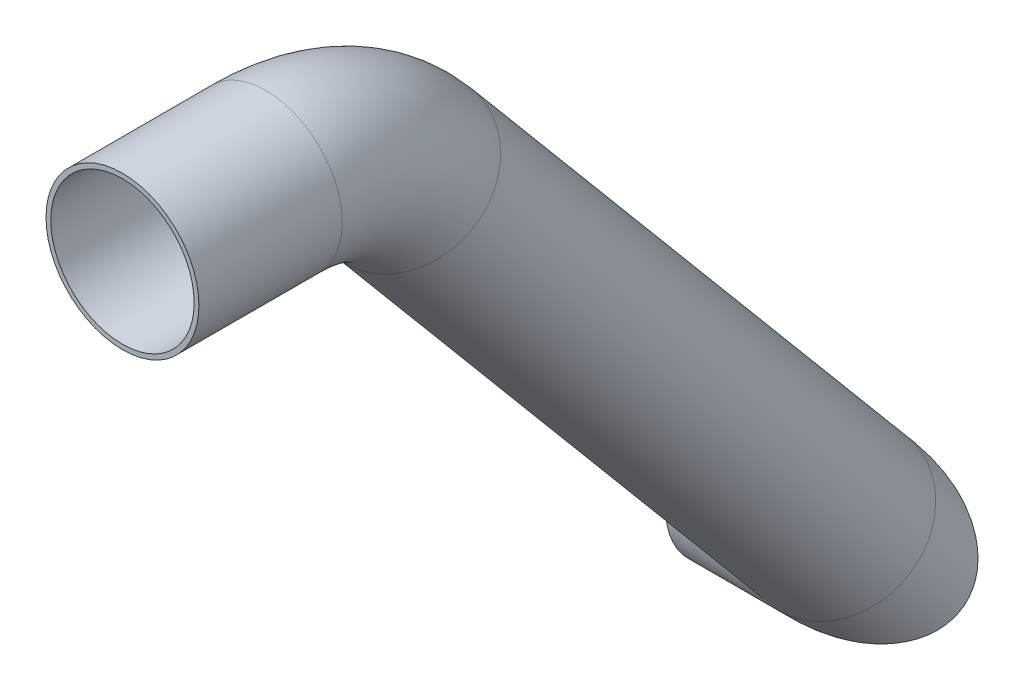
ISO-10303-21;
HEADER;
FILE_DESCRIPTION(('STEP AP214'),'2;1');
FILE_NAME('part.step','',(''),(''),'','','');
FILE_SCHEMA(('AUTOMOTIVE_DESIGN { 1 0 10303 214 1 1 1 1 }'));
ENDSEC;
DATA;
#1=APPLICATION_CONTEXT('core data for automotive mechanical design processes');
#2=APPLICATION_PROTOCOL_DEFINITION('international standard','automotive_design',2000,#1);
#3=PRODUCT_CONTEXT('',#1,'mechanical');
#4=PRODUCT('Part','Part','',(#3));
#5=PRODUCT_RELATED_PRODUCT_CATEGORY('part','',(#4));
#6=PRODUCT_DEFINITION_FORMATION('','',#4);
#7=PRODUCT_DEFINITION_CONTEXT('part definition',#1,'design');
#8=PRODUCT_DEFINITION('design','',#6,#7);
#9=PRODUCT_DEFINITION_SHAPE('','',#8);
#10=(LENGTH_UNIT() NAMED_UNIT(*) SI_UNIT(.MILLI.,.METRE.));
#11=(NAMED_UNIT(*) PLANE_ANGLE_UNIT() SI_UNIT($,.RADIAN.));
#12=(NAMED_UNIT(*) SI_UNIT($,.STERADIAN.) SOLID_ANGLE_UNIT());
#13=UNCERTAINTY_MEASURE_WITH_UNIT(LENGTH_MEASURE(1.E-05),#10,'distance_accuracy_value','');
#14=(GEOMETRIC_REPRESENTATION_CONTEXT(3) GLOBAL_UNCERTAINTY_ASSIGNED_CONTEXT((#13)) GLOBAL_UNIT_ASSIGNED_CONTEXT((#10,
#11,#12)) REPRESENTATION_CONTEXT('',''));
#15=CARTESIAN_POINT('',(0.,0.,0.));
#16=DIRECTION('',(0.,0.,1.));
#17=DIRECTION('',(1.,0.,0.));
#18=AXIS2_PLACEMENT_3D('',#15,#16,#17);
#19=CARTESIAN_POINT('',(-160.,0.,0.));
#20=DIRECTION('',(1.,0.,0.));
#21=DIRECTION('',(0.,0.,-1.));
#22=AXIS2_PLACEMENT_3D('',#19,#20,#21);
#23=CYLINDRICAL_SURFACE('',#22,150.);
#24=CARTESIAN_POINT('',(-203.56,0.,0.));
#25=DIRECTION('',(1.,0.,0.));
#26=DIRECTION('',(0.,0.,-1.));
#27=AXIS2_PLACEMENT_3D('',#24,#25,#26);
#28=CIRCLE('',#27,150.);
#29=CARTESIAN_POINT('',(-203.56,0.,-150.));
#30=VERTEX_POINT('',#29);
#31=EDGE_CURVE('E115',#30,#30,#28,.T.);
#32=ORIENTED_EDGE('',*,*,#31,.F.);
#33=EDGE_LOOP('',(#32));
#34=FACE_BOUND('',#33,.T.);
#35=CARTESIAN_POINT('',(0.,0.,0.));
#36=DIRECTION('',(-0.707106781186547,-0.541675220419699,-0.454519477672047));
#37=DIRECTION('',(-0.707106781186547,0.541675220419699,0.454519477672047));
#38=AXIS2_PLACEMENT_3D('',#35,#36,#37);
#39=ELLIPSE('',#38,212.132034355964,150.);
#40=CARTESIAN_POINT('',(-150.,114.906666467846,96.4181414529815));
#41=VERTEX_POINT('',#40);
#42=EDGE_CURVE('E93',#41,#41,#39,.T.);
#43=ORIENTED_EDGE('',*,*,#42,.F.);
#44=EDGE_LOOP('',(#43));
#45=FACE_BOUND('',#44,.T.);
#46=CARTESIAN_POINT('',(0.,-121.078910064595,-88.5431958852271));
#47=CARTESIAN_POINT('',(0.280617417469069,-121.078911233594,-88.5431938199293));
#48=CARTESIAN_POINT('',(0.561197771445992,-121.071920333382,-88.5527562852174));
#49=CARTESIAN_POINT('',(1.12045310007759,-121.043993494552,-88.5909262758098));
#50=CARTESIAN_POINT('',(1.39912757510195,-121.023054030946,-88.619538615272));
#51=CARTESIAN_POINT('',(1.95277616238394,-120.96730908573,-88.6956162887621));
#52=CARTESIAN_POINT('',(2.22774619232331,-120.932489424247,-88.7431009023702));
#53=CARTESIAN_POINT('',(2.77174912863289,-120.84917180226,-88.8565283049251));
#54=CARTESIAN_POINT('',(3.04078192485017,-120.800673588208,-88.9224714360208));
#55=CARTESIAN_POINT('',(3.57084536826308,-120.690292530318,-89.0722287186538));
#56=CARTESIAN_POINT('',(3.83188036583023,-120.628417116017,-89.1560329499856));
#57=CARTESIAN_POINT('',(4.34425997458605,-120.491601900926,-89.3408477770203));
#58=CARTESIAN_POINT('',(4.59560443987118,-120.416661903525,-89.4418586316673));
#59=CARTESIAN_POINT('',(5.08676684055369,-120.254147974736,-89.6602387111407));
#60=CARTESIAN_POINT('',(5.32658736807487,-120.166576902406,-89.7776042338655));
#61=CARTESIAN_POINT('',(5.79306663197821,-119.979275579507,-90.027761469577));
#62=CARTESIAN_POINT('',(6.0197256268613,-119.879545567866,-90.1605528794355));
#63=CARTESIAN_POINT('',(6.45862024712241,-119.668325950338,-90.4407130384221));
#64=CARTESIAN_POINT('',(6.67083365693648,-119.556818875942,-90.5881034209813));
#65=CARTESIAN_POINT('',(7.0789630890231,-119.32280652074,-90.8961233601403));
#66=CARTESIAN_POINT('',(7.27487908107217,-119.20030121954,-91.0567529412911));
#67=CARTESIAN_POINT('',(7.64903560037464,-118.945000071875,-91.3899940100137));
#68=CARTESIAN_POINT('',(7.82727539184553,-118.812203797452,-91.5626059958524));
#69=CARTESIAN_POINT('',(8.16480727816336,-118.5371134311,-91.9184600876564));
#70=CARTESIAN_POINT('',(8.32409937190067,-118.394819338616,-92.1017021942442));
#71=CARTESIAN_POINT('',(8.62274155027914,-118.101461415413,-92.4775739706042));
#72=CARTESIAN_POINT('',(8.76207317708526,-117.950389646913,-92.6702121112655));
#73=CARTESIAN_POINT('',(9.01962543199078,-117.64053440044,-93.0632434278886));
#74=CARTESIAN_POINT('',(9.13784604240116,-117.481750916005,-93.2636366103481));
#75=CARTESIAN_POINT('',(9.3523280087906,-117.157484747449,-93.67065421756));
#76=CARTESIAN_POINT('',(9.44858957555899,-116.992002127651,-93.8772785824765));
#77=CARTESIAN_POINT('',(9.61846252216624,-116.655415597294,-94.295206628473));
#78=CARTESIAN_POINT('',(9.6920739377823,-116.484311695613,-94.5065103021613));
#79=CARTESIAN_POINT('',(9.81602256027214,-116.137885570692,-94.9319053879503));
#80=CARTESIAN_POINT('',(9.86639452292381,-115.962570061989,-95.1459921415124));
#81=CARTESIAN_POINT('',(9.94366364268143,-115.608668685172,-95.5756935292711));
#82=CARTESIAN_POINT('',(9.97056082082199,-115.430082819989,-95.7913081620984));
#83=CARTESIAN_POINT('',(10.0006859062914,-115.070887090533,-96.2225008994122));
#84=CARTESIAN_POINT('',(10.0039140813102,-114.890277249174,-96.4380790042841));
#85=CARTESIAN_POINT('',(9.98667851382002,-114.528316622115,-96.8676601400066));
#86=CARTESIAN_POINT('',(9.96621479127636,-114.346965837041,-97.0816631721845));
#87=CARTESIAN_POINT('',(9.90179478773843,-113.985127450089,-97.5062480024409));
#88=CARTESIAN_POINT('',(9.85787595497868,-113.804638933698,-97.7168347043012));
#89=CARTESIAN_POINT('',(9.74688530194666,-113.445563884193,-98.1334788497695));
#90=CARTESIAN_POINT('',(9.67981351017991,-113.266977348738,-98.3395362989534));
#91=CARTESIAN_POINT('',(9.52299784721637,-112.913042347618,-98.7457211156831));
#92=CARTESIAN_POINT('',(9.43325386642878,-112.737693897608,-98.9458484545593));
#93=CARTESIAN_POINT('',(9.23173590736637,-112.391569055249,-99.3388331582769));
#94=CARTESIAN_POINT('',(9.11996190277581,-112.220792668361,-99.5316905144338));
#95=CARTESIAN_POINT('',(8.87508332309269,-111.884996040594,-99.9090161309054));
#96=CARTESIAN_POINT('',(8.74196186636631,-111.719980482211,-100.09347760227));
#97=CARTESIAN_POINT('',(8.45539899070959,-111.397140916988,-100.45265209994));
#98=CARTESIAN_POINT('',(8.30195756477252,-111.239316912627,-100.627365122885));
#99=CARTESIAN_POINT('',(7.97584089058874,-110.932111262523,-100.965929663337));
#100=CARTESIAN_POINT('',(7.8031654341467,-110.78272970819,-101.129781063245));
#101=CARTESIAN_POINT('',(7.43980285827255,-110.49361132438,-101.445589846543));
#102=CARTESIAN_POINT('',(7.24911571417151,-110.353874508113,-101.597547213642));
#103=CARTESIAN_POINT('',(6.85068731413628,-110.084920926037,-101.888908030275));
#104=CARTESIAN_POINT('',(6.64291356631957,-109.955725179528,-102.028286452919));
#105=CARTESIAN_POINT('',(6.21210491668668,-109.709225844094,-102.29329657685));
#106=CARTESIAN_POINT('',(5.98906999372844,-109.591922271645,-102.418928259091));
#107=CARTESIAN_POINT('',(5.52931672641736,-109.370188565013,-102.65567772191));
#108=CARTESIAN_POINT('',(5.29259836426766,-109.265758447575,-102.76679548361));
#109=CARTESIAN_POINT('',(4.8071545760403,-109.070655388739,-102.973843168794));
#110=CARTESIAN_POINT('',(4.55842915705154,-108.979982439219,-103.069773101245));
#111=CARTESIAN_POINT('',(4.05071700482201,-108.813163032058,-103.245872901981));
#112=CARTESIAN_POINT('',(3.79172956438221,-108.737017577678,-103.326041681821));
#113=CARTESIAN_POINT('',(3.26534933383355,-108.599918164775,-103.470129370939));
#114=CARTESIAN_POINT('',(2.99795654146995,-108.538964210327,-103.534048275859));
#115=CARTESIAN_POINT('',(2.45667224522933,-108.432778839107,-103.645252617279));
#116=CARTESIAN_POINT('',(2.18278081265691,-108.387547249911,-103.692538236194));
#117=CARTESIAN_POINT('',(1.63045023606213,-108.313201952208,-103.77019406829));
#118=CARTESIAN_POINT('',(1.35201109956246,-108.284088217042,-103.800564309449));
#119=CARTESIAN_POINT('',(0.793112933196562,-108.242275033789,-103.84416598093));
#120=CARTESIAN_POINT('',(0.512658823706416,-108.229544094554,-103.857430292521));
#121=CARTESIAN_POINT('',(-0.0488006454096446,-108.220505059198,-103.86684903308));
#122=CARTESIAN_POINT('',(-0.329806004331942,-108.224196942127,-103.863003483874));
#123=CARTESIAN_POINT('',(-0.890364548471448,-108.247970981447,-103.838225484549));
#124=CARTESIAN_POINT('',(-1.1699177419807,-108.268053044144,-103.817293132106));
#125=CARTESIAN_POINT('',(-1.72558316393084,-108.324430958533,-103.758466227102));
#126=CARTESIAN_POINT('',(-2.00169539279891,-108.360726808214,-103.720571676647));
#127=CARTESIAN_POINT('',(-2.54826540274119,-108.449174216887,-103.628088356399));
#128=CARTESIAN_POINT('',(-2.81872811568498,-108.501311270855,-103.573514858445));
#129=CARTESIAN_POINT('',(-3.35234210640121,-108.620999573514,-103.447986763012));
#130=CARTESIAN_POINT('',(-3.61549339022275,-108.688550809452,-103.377032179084));
#131=CARTESIAN_POINT('',(-4.13262580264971,-108.838485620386,-103.219164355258));
#132=CARTESIAN_POINT('',(-4.38660685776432,-108.920869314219,-103.132250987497));
#133=CARTESIAN_POINT('',(-4.88360436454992,-109.099764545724,-102.942985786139));
#134=CARTESIAN_POINT('',(-5.12662079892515,-109.196276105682,-102.840633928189));
#135=CARTESIAN_POINT('',(-5.60033787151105,-109.402767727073,-102.620939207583));
#136=CARTESIAN_POINT('',(-5.83101915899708,-109.512768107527,-102.503573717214));
#137=CARTESIAN_POINT('',(-6.27803753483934,-109.745196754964,-102.25468580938));
#138=CARTESIAN_POINT('',(-6.49437461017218,-109.867625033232,-102.123163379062));
#139=CARTESIAN_POINT('',(-6.91117994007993,-110.123894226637,-101.84676443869));
#140=CARTESIAN_POINT('',(-7.11164803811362,-110.25773525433,-101.701887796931));
#141=CARTESIAN_POINT('',(-7.49529762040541,-110.535730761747,-101.399676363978));
#142=CARTESIAN_POINT('',(-7.67847909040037,-110.67988524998,-101.242341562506));
#143=CARTESIAN_POINT('',(-8.02653559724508,-110.977575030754,-100.915938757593));
#144=CARTESIAN_POINT('',(-8.19138117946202,-111.131124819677,-100.746852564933));
#145=CARTESIAN_POINT('',(-8.50125915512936,-111.446165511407,-100.398243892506));
#146=CARTESIAN_POINT('',(-8.64629152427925,-111.607656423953,-100.218721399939));
#147=CARTESIAN_POINT('',(-8.9155077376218,-111.937298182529,-99.8503998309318));
#148=CARTESIAN_POINT('',(-9.03969168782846,-112.105448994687,-99.6616008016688));
#149=CARTESIAN_POINT('',(-9.26632289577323,-112.447095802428,-99.2759638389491));
#150=CARTESIAN_POINT('',(-9.36877018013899,-112.620591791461,-99.0791259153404));
#151=CARTESIAN_POINT('',(-9.55111705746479,-112.971446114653,-98.6788889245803));
#152=CARTESIAN_POINT('',(-9.63103515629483,-113.148801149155,-98.4754953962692));
#153=CARTESIAN_POINT('',(-9.76786077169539,-113.50616609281,-98.0633705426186));
#154=CARTESIAN_POINT('',(-9.82476829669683,-113.686176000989,-97.854639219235));
#155=CARTESIAN_POINT('',(-9.91516164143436,-114.047504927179,-97.4332778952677));
#156=CARTESIAN_POINT('',(-9.94864768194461,-114.228823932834,-97.2206479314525));
#157=CARTESIAN_POINT('',(-9.99195672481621,-114.591442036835,-96.7929749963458));
#158=CARTESIAN_POINT('',(-10.0017797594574,-114.772741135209,-96.5779320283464));
#159=CARTESIAN_POINT('',(-9.99769581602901,-115.133662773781,-96.1473788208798));
#160=CARTESIAN_POINT('',(-9.98383486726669,-115.313287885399,-95.9318702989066));
#161=CARTESIAN_POINT('',(-9.93257108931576,-115.669954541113,-95.5015168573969));
#162=CARTESIAN_POINT('',(-9.89516829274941,-115.846996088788,-95.2866719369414));
#163=CARTESIAN_POINT('',(-9.79709015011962,-116.197277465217,-94.8592065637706));
#164=CARTESIAN_POINT('',(-9.73641478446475,-116.370517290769,-94.6465861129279));
#165=CARTESIAN_POINT('',(-9.59222747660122,-116.712029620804,-94.2251331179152));
#166=CARTESIAN_POINT('',(-9.50871552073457,-116.880302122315,-94.0163005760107));
#167=CARTESIAN_POINT('',(-9.31945493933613,-117.21077110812,-93.6039793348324));
#168=CARTESIAN_POINT('',(-9.21370667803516,-117.372967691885,-93.4004905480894));
#169=CARTESIAN_POINT('',(-8.98072770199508,-117.690247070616,-93.0003814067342));
#170=CARTESIAN_POINT('',(-8.85349698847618,-117.845329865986,-92.803761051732));
#171=CARTESIAN_POINT('',(-8.57846179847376,-118.147406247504,-92.4188847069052));
#172=CARTESIAN_POINT('',(-8.43065786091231,-118.294400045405,-92.2306284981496));
#173=CARTESIAN_POINT('',(-8.11552151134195,-118.579403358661,-91.8639158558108));
#174=CARTESIAN_POINT('',(-7.9481890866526,-118.717412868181,-91.685459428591));
#175=CARTESIAN_POINT('',(-7.5948580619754,-118.983863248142,-91.3394113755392));
#176=CARTESIAN_POINT('',(-7.40882617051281,-119.112286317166,-91.1718400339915));
#177=CARTESIAN_POINT('',(-7.01966233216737,-119.358533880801,-90.8492244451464));
#178=CARTESIAN_POINT('',(-6.81653000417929,-119.476358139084,-90.6941804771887));
#179=CARTESIAN_POINT('',(-6.39455342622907,-119.700751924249,-90.3978127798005));
#180=CARTESIAN_POINT('',(-6.1757053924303,-119.807318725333,-90.2564923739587));
#181=CARTESIAN_POINT('',(-5.72389146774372,-120.008558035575,-89.9887440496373));
#182=CARTESIAN_POINT('',(-5.49092578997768,-120.103230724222,-89.862315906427));
#183=CARTESIAN_POINT('',(-5.01219201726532,-120.280274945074,-89.6252051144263));
#184=CARTESIAN_POINT('',(-4.76640680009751,-120.362629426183,-89.5145443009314));
#185=CARTESIAN_POINT('',(-4.26407966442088,-120.514422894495,-89.3100783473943));
#186=CARTESIAN_POINT('',(-4.00753794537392,-120.583862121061,-89.2162728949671));
#187=CARTESIAN_POINT('',(-3.48578175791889,-120.70938055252,-89.0463733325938));
#188=CARTESIAN_POINT('',(-3.22057653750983,-120.765473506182,-88.9702609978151));
#189=CARTESIAN_POINT('',(-2.68322147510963,-120.864071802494,-88.8362710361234));
#190=CARTESIAN_POINT('',(-2.41107342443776,-120.906580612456,-88.7783887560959));
#191=CARTESIAN_POINT('',(-1.78586490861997,-120.987625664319,-88.6679222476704));
#192=CARTESIAN_POINT('',(-1.43118415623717,-121.021835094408,-88.6211989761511));
#193=CARTESIAN_POINT('',(-0.717648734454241,-121.067476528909,-88.5588371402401));
#194=CARTESIAN_POINT('',(-0.358794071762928,-121.078908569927,-88.5431985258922));
#195=CARTESIAN_POINT('',(0.,-121.078910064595,-88.5431958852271));
#196=B_SPLINE_CURVE_WITH_KNOTS('',3,(#46,#47,#48,#49,#50,#51,#52,#53,#54,#55,#56,#57,#58,#59,
#60,#61,#62,#63,#64,#65,#66,#67,#68,#69,#70,#71,#72,#73,#74,#75,#76,#77,#78,#79,#80,#81,#82,#83,
#84,#85,#86,#87,#88,#89,#90,#91,#92,#93,#94,#95,#96,#97,#98,#99,#100,#101,#102,#103,#104,#105,
#106,#107,#108,#109,#110,#111,#112,#113,#114,#115,#116,#117,#118,#119,#120,#121,#122,#123,#124,
#125,#126,#127,#128,#129,#130,#131,#132,#133,#134,#135,#136,#137,#138,#139,#140,#141,#142,#143,
#144,#145,#146,#147,#148,#149,#150,#151,#152,#153,#154,#155,#156,#157,#158,#159,#160,#161,#162,
#163,#164,#165,#166,#167,#168,#169,#170,#171,#172,#173,#174,#175,#176,#177,#178,#179,#180,#181,
#182,#183,#184,#185,#186,#187,#188,#189,#190,#191,#192,#193,#194,#195),.UNSPECIFIED.,.T.,.F.,(4,
2,2,2,2,2,2,2,2,2,2,2,2,2,2,2,2,2,2,2,2,2,2,2,2,2,2,2,2,2,2,2,2,2,2,2,2,2,2,2,2,2,2,2,2,2,2,2,2,
2,2,2,2,2,2,2,2,2,2,2,2,2,2,2,2,2,2,2,2,2,2,2,2,2,4),(0.,0.841538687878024,1.68329012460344,
2.52590369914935,3.36853289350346,4.21069529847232,5.05287037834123,5.8948551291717,
6.73682333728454,7.58005842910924,8.42329508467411,9.26656682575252,10.1098386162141,
10.9538852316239,11.7979325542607,12.6419717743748,13.4860096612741,14.3287811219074,
15.1715518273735,16.0143130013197,16.8570734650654,17.6984923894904,18.5399102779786,
19.3813322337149,20.2227551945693,21.0648468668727,21.9069388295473,22.749039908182,
23.5911421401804,24.4348844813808,25.2786279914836,26.1223725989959,26.9661167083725,
27.8099190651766,28.653721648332,29.4975149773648,30.3413069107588,31.1834744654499,
32.0256409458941,32.8678026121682,33.7099641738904,34.5513569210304,35.3927489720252,
36.2341477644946,37.0755478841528,37.9182313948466,38.7609156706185,39.6036082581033,
40.4463015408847,41.2903295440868,42.1343585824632,42.9783833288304,43.8224070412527,
44.6657354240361,45.5090634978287,46.3523836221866,47.1957025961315,48.0373844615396,
48.8790651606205,49.7207465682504,50.5624284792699,51.4040966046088,52.2457646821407,
53.0874107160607,53.92905729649,54.772229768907,55.6154210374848,56.458816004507,
57.3021982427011,58.1467373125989,58.99126072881,59.8349103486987,60.678344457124,
61.7543274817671,62.8303087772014),.UNSPECIFIED.);
#197=CARTESIAN_POINT('',(0.,-121.078910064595,-88.5431958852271));
#198=VERTEX_POINT('',#197);
#199=EDGE_CURVE('E71',#198,#198,#196,.T.);
#200=ORIENTED_EDGE('',*,*,#199,.F.);
#201=EDGE_LOOP('',(#200));
#202=FACE_BOUND('',#201,.T.);
#203=ADVANCED_FACE('F67',(#34,#45,#202),#23,.F.);
#204=CARTESIAN_POINT('',(0.,1220.,1500.));
#205=DIRECTION('',(0.,0.,1.));
#206=DIRECTION('',(0.,-1.,0.));
#207=AXIS2_PLACEMENT_3D('',#204,#205,#206);
#208=PLANE('',#207);
#209=CARTESIAN_POINT('',(0.,1220.,1500.));
#210=DIRECTION('',(0.,0.,1.));
#211=DIRECTION('',(0.,-1.,0.));
#212=AXIS2_PLACEMENT_3D('',#209,#210,#211);
#213=CIRCLE('',#212,150.);
#214=CARTESIAN_POINT('',(0.,1070.,1500.));
#215=VERTEX_POINT('',#214);
#216=EDGE_CURVE('E118',#215,#215,#213,.T.);
#217=ORIENTED_EDGE('',*,*,#216,.F.);
#218=EDGE_LOOP('',(#217));
#219=FACE_BOUND('',#218,.T.);
#220=CARTESIAN_POINT('',(0.,1220.,1500.));
#221=DIRECTION('',(0.,0.,1.));
#222=DIRECTION('',(0.,-1.,0.));
#223=AXIS2_PLACEMENT_3D('',#220,#221,#222);
#224=CIRCLE('',#223,160.);
#225=CARTESIAN_POINT('',(0.,1060.,1500.));
#226=VERTEX_POINT('',#225);
#227=EDGE_CURVE('E108',#226,#226,#224,.T.);
#228=ORIENTED_EDGE('',*,*,#227,.T.);
#229=EDGE_LOOP('',(#228));
#230=FACE_BOUND('',#229,.T.);
#231=ADVANCED_FACE('F69',(#219,#230),#208,.T.);
#232=CARTESIAN_POINT('',(0.,1220.,1500.));
#233=DIRECTION('',(0.,0.,-1.));
#234=DIRECTION('',(0.,1.,0.));
#235=AXIS2_PLACEMENT_3D('',#232,#233,#234);
#236=CYLINDRICAL_SURFACE('',#235,160.);
#237=CARTESIAN_POINT('',(0.,1220.,1200.));
#238=DIRECTION('',(0.,0.,1.));
#239=DIRECTION('',(0.,-1.,0.));
#240=AXIS2_PLACEMENT_3D('',#237,#238,#239);
#241=CIRCLE('',#240,160.);
#242=CARTESIAN_POINT('',(0.,1380.,1200.));
#243=VERTEX_POINT('',#242);
#244=EDGE_CURVE('E103',#243,#243,#241,.T.);
#245=ORIENTED_EDGE('',*,*,#244,.T.);
#246=EDGE_LOOP('',(#245));
#247=FACE_BOUND('',#246,.T.);
#248=ORIENTED_EDGE('',*,*,#227,.F.);
#249=EDGE_LOOP('',(#248));
#250=FACE_BOUND('',#249,.T.);
#251=ADVANCED_FACE('F141',(#247,#250),#236,.T.);
#252=CARTESIAN_POINT('',(0.,841.92675397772,1200.));
#253=DIRECTION('',(-1.,0.,0.));
#254=DIRECTION('',(0.,0.,1.));
#255=AXIS2_PLACEMENT_3D('',#252,#253,#254);
#256=TOROIDAL_SURFACE('',#255,378.07324602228,160.);
#257=CARTESIAN_POINT('',(0.,1084.94755207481,910.37909079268));
#258=DIRECTION('',(0.,0.766044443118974,0.642787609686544));
#259=DIRECTION('',(0.,-0.642787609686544,0.766044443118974));
#260=AXIS2_PLACEMENT_3D('',#257,#258,#259);
#261=CIRCLE('',#260,160.);
#262=CARTESIAN_POINT('',(0.,1187.79356962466,787.811979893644));
#263=VERTEX_POINT('',#262);
#264=EDGE_CURVE('E100',#263,#263,#261,.T.);
#265=CARTESIAN_POINT('',(0.,841.92675397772,1200.));
#266=DIRECTION('',(-1.,0.,0.));
#267=DIRECTION('',(0.,0.,1.));
#268=AXIS2_PLACEMENT_3D('',#265,#266,#267);
#269=CIRCLE('',#268,538.07324602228);
#270=EDGE_CURVE('',#243,#263,#269,.T.);
#271=ORIENTED_EDGE('',*,*,#244,.F.);
#272=ORIENTED_EDGE('',*,*,#264,.T.);
#273=ORIENTED_EDGE('',*,*,#270,.T.);
#274=ORIENTED_EDGE('',*,*,#270,.F.);
#275=EDGE_LOOP('',(#271,#273,#272,#274));
#276=FACE_BOUND('',#275,.T.);
#277=ADVANCED_FACE('F154',(#276),#256,.T.);
#278=CARTESIAN_POINT('',(0.,1084.94755207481,910.37909079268));
#279=DIRECTION('',(0.,-0.766044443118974,-0.642787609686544));
#280=DIRECTION('',(0.,0.642787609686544,-0.766044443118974));
#281=AXIS2_PLACEMENT_3D('',#278,#279,#280);
#282=CYLINDRICAL_SURFACE('',#281,160.);
#283=CARTESIAN_POINT('',(0.,4.9960036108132E-13,3.88578058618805E-13));
#284=DIRECTION('',(0.,0.766044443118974,0.642787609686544));
#285=DIRECTION('',(0.,-0.642787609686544,0.766044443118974));
#286=AXIS2_PLACEMENT_3D('',#283,#284,#285);
#287=CIRCLE('',#286,160.);
#288=CARTESIAN_POINT('',(0.,-102.846017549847,122.567110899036));
#289=VERTEX_POINT('',#288);
#290=CARTESIAN_POINT('',(0.,102.846017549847,-122.567110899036));
#291=VERTEX_POINT('',#290);
#292=EDGE_CURVE('E81',#289,#291,#287,.T.);
#293=ORIENTED_EDGE('',*,*,#292,.T.);
#294=CARTESIAN_POINT('',(0.,0.,0.));
#295=DIRECTION('',(-0.707106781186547,-0.541675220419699,-0.454519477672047));
#296=DIRECTION('',(0.707106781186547,-0.541675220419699,-0.454519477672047));
#297=AXIS2_PLACEMENT_3D('',#294,#295,#296);
#298=ELLIPSE('',#297,226.274169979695,160.);
#299=EDGE_CURVE('E87',#291,#289,#298,.F.);
#300=ORIENTED_EDGE('',*,*,#299,.T.);
#301=EDGE_LOOP('',(#293,#300));
#302=FACE_BOUND('',#301,.T.);
#303=ORIENTED_EDGE('',*,*,#264,.F.);
#304=EDGE_LOOP('',(#303));
#305=FACE_BOUND('',#304,.T.);
#306=ADVANCED_FACE('F98',(#302,#305),#282,.T.);
#307=CARTESIAN_POINT('',(0.,0.,0.));
#308=DIRECTION('',(0.,-0.766044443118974,-0.642787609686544));
#309=DIRECTION('',(0.,0.642787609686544,-0.766044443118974));
#310=AXIS2_PLACEMENT_3D('',#307,#308,#309);
#311=CYLINDRICAL_SURFACE('',#310,160.);
#312=ORIENTED_EDGE('',*,*,#292,.F.);
#313=CARTESIAN_POINT('',(0.,0.,0.));
#314=DIRECTION('',(-0.707106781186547,-0.541675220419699,-0.454519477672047));
#315=DIRECTION('',(0.707106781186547,-0.541675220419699,-0.454519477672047));
#316=AXIS2_PLACEMENT_3D('',#313,#314,#315);
#317=ELLIPSE('',#316,226.274169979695,160.);
#318=EDGE_CURVE('E13',#289,#291,#317,.F.);
#319=ORIENTED_EDGE('',*,*,#318,.T.);
#320=EDGE_LOOP('',(#312,#319));
#321=FACE_BOUND('',#320,.T.);
#322=ADVANCED_FACE('F97',(#321),#311,.T.);
#323=CARTESIAN_POINT('',(-160.,0.,0.));
#324=DIRECTION('',(1.,0.,0.));
#325=DIRECTION('',(0.,0.,-1.));
#326=AXIS2_PLACEMENT_3D('',#323,#324,#325);
#327=CYLINDRICAL_SURFACE('',#326,160.);
#328=ORIENTED_EDGE('',*,*,#318,.F.);
#329=ORIENTED_EDGE('',*,*,#299,.F.);
#330=EDGE_LOOP('',(#328,#329));
#331=FACE_BOUND('',#330,.T.);
#332=CARTESIAN_POINT('',(-203.56,0.,0.));
#333=DIRECTION('',(1.,0.,0.));
#334=DIRECTION('',(0.,0.,-1.));
#335=AXIS2_PLACEMENT_3D('',#332,#333,#334);
#336=CIRCLE('',#335,160.);
#337=CARTESIAN_POINT('',(-203.56,0.,-160.));
#338=VERTEX_POINT('',#337);
#339=EDGE_CURVE('E94',#338,#338,#336,.T.);
#340=ORIENTED_EDGE('',*,*,#339,.T.);
#341=EDGE_LOOP('',(#340));
#342=FACE_BOUND('',#341,.T.);
#343=ADVANCED_FACE('F90',(#331,#342),#327,.T.);
#344=CARTESIAN_POINT('',(-203.56,0.,0.));
#345=DIRECTION('',(1.,0.,0.));
#346=DIRECTION('',(0.,0.,-1.));
#347=AXIS2_PLACEMENT_3D('',#344,#345,#346);
#348=PLANE('',#347);
#349=ORIENTED_EDGE('',*,*,#31,.T.);
#350=EDGE_LOOP('',(#349));
#351=FACE_BOUND('',#350,.T.);
#352=ORIENTED_EDGE('',*,*,#339,.F.);
#353=EDGE_LOOP('',(#352));
#354=FACE_BOUND('',#353,.T.);
#355=ADVANCED_FACE('F153',(#351,#354),#348,.F.);
#356=CARTESIAN_POINT('',(0.,0.,0.));
#357=DIRECTION('',(0.,-0.766044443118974,-0.642787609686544));
#358=DIRECTION('',(0.,0.642787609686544,-0.766044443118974));
#359=AXIS2_PLACEMENT_3D('',#356,#357,#358);
#360=CYLINDRICAL_SURFACE('',#359,150.);
#361=ORIENTED_EDGE('',*,*,#42,.T.);
#362=EDGE_LOOP('',(#361));
#363=FACE_BOUND('',#362,.T.);
#364=CARTESIAN_POINT('',(0.,1084.94755207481,910.379090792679));
#365=DIRECTION('',(0.,0.766044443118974,0.642787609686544));
#366=DIRECTION('',(0.,-0.642787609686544,0.766044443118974));
#367=AXIS2_PLACEMENT_3D('',#364,#365,#366);
#368=CIRCLE('',#367,150.);
#369=CARTESIAN_POINT('',(0.,1181.36569352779,795.472424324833));
#370=VERTEX_POINT('',#369);
#371=EDGE_CURVE('E121',#370,#370,#368,.T.);
#372=ORIENTED_EDGE('',*,*,#371,.T.);
#373=EDGE_LOOP('',(#372));
#374=FACE_BOUND('',#373,.T.);
#375=ADVANCED_FACE('F201',(#363,#374),#360,.F.);
#376=CARTESIAN_POINT('',(0.,1220.,1504.));
#377=DIRECTION('',(0.,0.,-1.));
#378=DIRECTION('',(0.,1.,0.));
#379=AXIS2_PLACEMENT_3D('',#376,#377,#378);
#380=CYLINDRICAL_SURFACE('',#379,150.);
#381=CARTESIAN_POINT('',(0.,1220.,1200.));
#382=DIRECTION('',(0.,0.,1.));
#383=DIRECTION('',(0.,-1.,0.));
#384=AXIS2_PLACEMENT_3D('',#381,#382,#383);
#385=CIRCLE('',#384,150.);
#386=CARTESIAN_POINT('',(0.,1370.,1200.));
#387=VERTEX_POINT('',#386);
#388=EDGE_CURVE('E122',#387,#387,#385,.T.);
#389=ORIENTED_EDGE('',*,*,#388,.F.);
#390=EDGE_LOOP('',(#389));
#391=FACE_BOUND('',#390,.T.);
#392=ORIENTED_EDGE('',*,*,#216,.T.);
#393=EDGE_LOOP('',(#392));
#394=FACE_BOUND('',#393,.T.);
#395=ADVANCED_FACE('F218',(#391,#394),#380,.F.);
#396=CARTESIAN_POINT('',(0.,841.92675397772,1200.));
#397=DIRECTION('',(-1.,0.,0.));
#398=DIRECTION('',(0.,0.,1.));
#399=AXIS2_PLACEMENT_3D('',#396,#397,#398);
#400=TOROIDAL_SURFACE('',#399,378.07324602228,150.);
#401=CARTESIAN_POINT('',(0.,841.92675397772,1200.));
#402=DIRECTION('',(-1.,0.,0.));
#403=DIRECTION('',(0.,0.,1.));
#404=AXIS2_PLACEMENT_3D('',#401,#402,#403);
#405=CIRCLE('',#404,528.07324602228);
#406=EDGE_CURVE('',#387,#370,#405,.T.);
#407=ORIENTED_EDGE('',*,*,#388,.T.);
#408=ORIENTED_EDGE('',*,*,#371,.F.);
#409=ORIENTED_EDGE('',*,*,#406,.T.);
#410=ORIENTED_EDGE('',*,*,#406,.F.);
#411=EDGE_LOOP('',(#407,#409,#408,#410));
#412=FACE_BOUND('',#411,.T.);
#413=ADVANCED_FACE('F227',(#412),#400,.F.);
#414=CARTESIAN_POINT('',(0.,-118.736888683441,-99.6320795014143));
#415=DIRECTION('',(0.,0.766044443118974,0.642787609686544));
#416=DIRECTION('',(0.,-0.642787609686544,0.766044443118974));
#417=AXIS2_PLACEMENT_3D('',#414,#415,#416);
#418=CYLINDRICAL_SURFACE('',#417,10.);
#419=CARTESIAN_POINT('',(0.,-118.736888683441,-99.6320795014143));
#420=DIRECTION('',(0.,-0.766044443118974,-0.642787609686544));
#421=DIRECTION('',(0.,0.642787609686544,-0.766044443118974));
#422=AXIS2_PLACEMENT_3D('',#419,#420,#421);
#423=CIRCLE('',#422,10.);
#424=CARTESIAN_POINT('',(0.,-112.309012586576,-107.292523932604));
#425=VERTEX_POINT('',#424);
#426=EDGE_CURVE('E127',#425,#425,#423,.T.);
#427=ORIENTED_EDGE('',*,*,#426,.T.);
#428=EDGE_LOOP('',(#427));
#429=FACE_BOUND('',#428,.T.);
#430=ORIENTED_EDGE('',*,*,#199,.T.);
#431=EDGE_LOOP('',(#430));
#432=FACE_BOUND('',#431,.T.);
#433=ADVANCED_FACE('F134',(#429,#432),#418,.F.);
#434=CARTESIAN_POINT('',(0.,-118.736888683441,-99.6320795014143));
#435=DIRECTION('',(0.,-0.766044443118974,-0.642787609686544));
#436=DIRECTION('',(0.,0.642787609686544,-0.766044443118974));
#437=AXIS2_PLACEMENT_3D('',#434,#435,#436);
#438=PLANE('',#437);
#439=ORIENTED_EDGE('',*,*,#426,.F.);
#440=EDGE_LOOP('',(#439));
#441=FACE_BOUND('',#440,.T.);
#442=ADVANCED_FACE('F253',(#441),#438,.F.);
#443=CLOSED_SHELL('',(#203,#231,#251,#277,#306,#322,#343,#355,#375,#395,#413,#433,#442));
#444=MANIFOLD_SOLID_BREP('B2',#443);
#445=ADVANCED_BREP_SHAPE_REPRESENTATION('',(#18,#444),#14);
#446=SHAPE_DEFINITION_REPRESENTATION(#9,#445);
ENDSEC;
END-ISO-10303-21;
